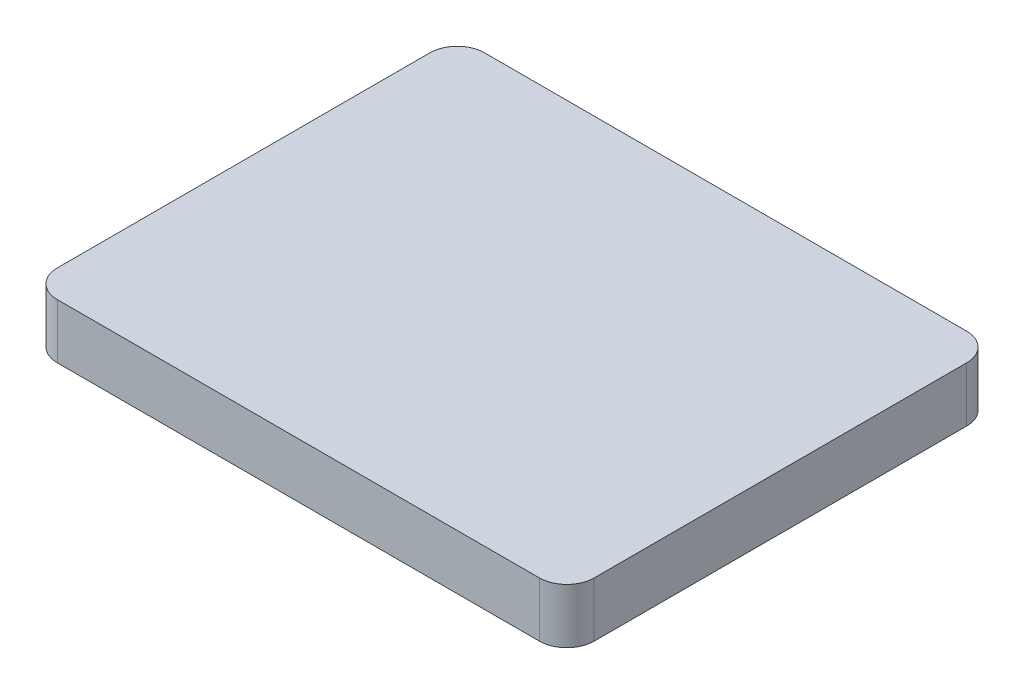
from build123d import *

# Parameters (mm, degrees)
SKETCH_1_W      = 9.8
SKETCH_1_H      = 7.8
EXTRUDE_1_DEPTH = 1
FILLET_1_R      = 0.5


with BuildPart() as part:
    # Sketch 1 → Extrude 1 (new body)
    with BuildSketch(Plane(origin=(0, 0, 0), x_dir=(1, 0, 0), z_dir=(0, 1, 0))):
        Rectangle(SKETCH_1_W, SKETCH_1_H)
    extrude(amount=EXTRUDE_1_DEPTH)

    # Fillet 1
    fillet_1_edges = [part.edges().sort_by_distance(p)[0] for p in [
        (4.9, 0.5, 3.9),
        (-4.9, 0.5, 3.9),
        (-4.9, 0.5, -3.9),
        (4.9, 0.5, -3.9),
    ]]
    fillet(fillet_1_edges, radius=FILLET_1_R)


solid = part.part
